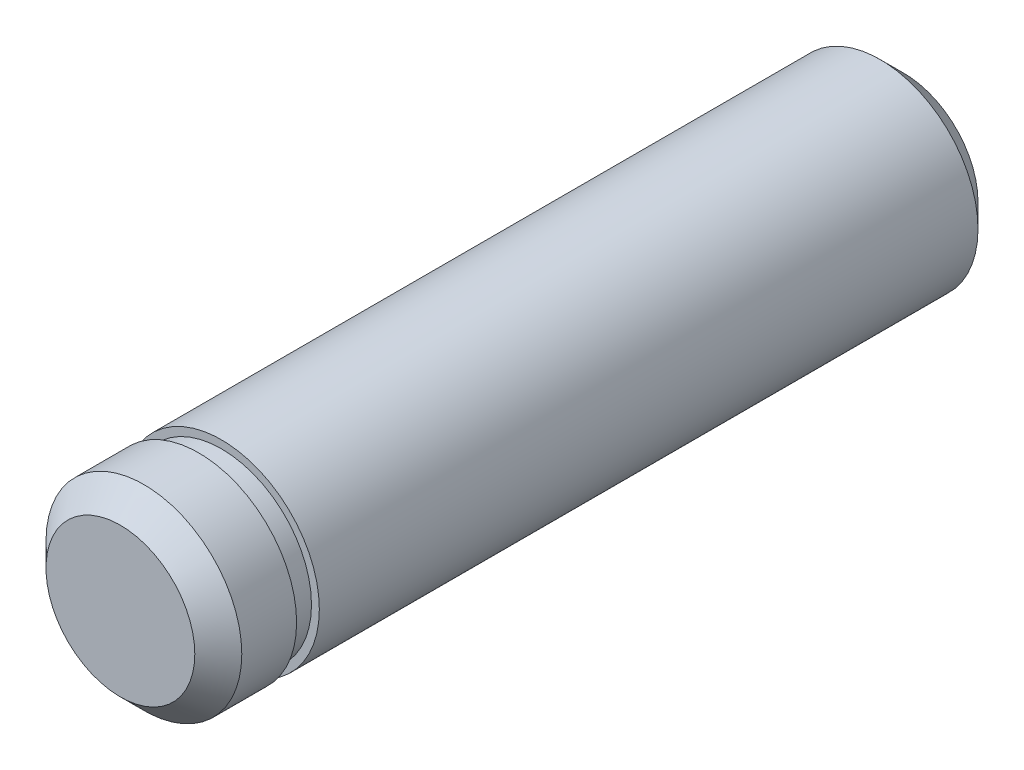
from build123d import *

# Parameters (mm, degrees)
SKETCH1_R           = 3.175
BOSS_EXTRUDE1_DEPTH = 25.4
CHAMFER1_SIZE       = 0.762
CUT_EXTRUDE1_START  = -3.2766
SKETCH2_R           = 3.175
SKETCH2_R_2         = 2.921
CUT_EXTRUDE1_DEPTH  = 0.7366


with BuildPart() as part:
    # Sketch1 → Boss-Extrude1 (new body)
    with BuildSketch(Plane.XY):
        Circle(SKETCH1_R)
    extrude(amount=BOSS_EXTRUDE1_DEPTH)

    # Chamfer1
    chamfer1_edges = [part.edges().sort_by_distance(p)[0] for p in [
        (-3.175, 0, 0),
        (-3.175, 0, 25.4),
    ]]
    chamfer(chamfer1_edges, length=CHAMFER1_SIZE)

    # Sketch2 → Cut-Extrude1 (cut)
    with BuildSketch(Plane.XY.offset(25.4).offset(CUT_EXTRUDE1_START)):
        Circle(SKETCH2_R)
        Circle(SKETCH2_R_2, mode=Mode.SUBTRACT)
    extrude(amount=CUT_EXTRUDE1_DEPTH, mode=Mode.SUBTRACT)


solid = part.part
